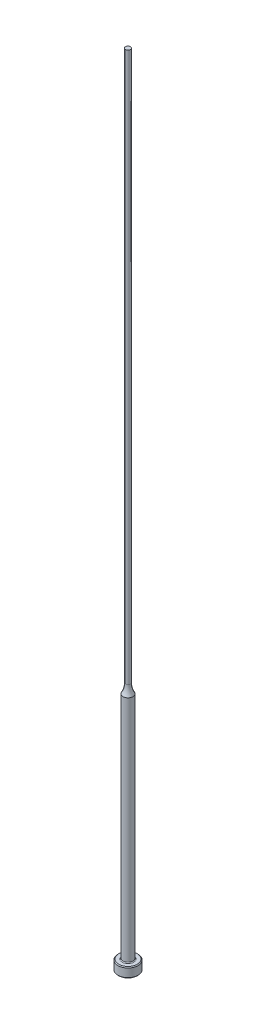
from build123d import *

# Parameters (mm, degrees)
CHAMFER1_SIZE = 0.254
FILLET1_R     = 0.254


with BuildPart() as part:
    # Sketch1 → Revolve1 (revolve)
    with BuildSketch(Plane.XY, mode=Mode.PRIVATE) as revolve1_sk:
        with BuildLine():
            Line((0, 0), (-3.175, 0))
            Line((-3.175, 0), (-3.175, 3.175))
            Line((-3.175, 3.175), (-1.5875, 3.175))
            Line((-1.5875, 3.175), (-1.5875, 76.2))
            ThreePointArc((-1.5875, 76.2), (-0.995388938, 77.686680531), (-0.79375, 79.274180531))
            Line((-0.79375, 79.274180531), (-0.79375, 254))
            Line((-0.79375, 254), (0, 254))
            Line((0, 254), (0, 0))
        make_face()
    revolve(revolve1_sk.sketch.rotate(Axis((0, 259.958771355, 0), (0, -1, 0)), 270), axis=Axis((0, 259.958771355, 0), (0, -1, 0)))

    # Chamfer1
    chamfer1_edges = [part.edges().sort_by_distance(p)[0] for p in [
        (0, 0, -3.175),
        (0, 3.175, -3.175),
    ]]
    chamfer(chamfer1_edges, length=CHAMFER1_SIZE)

    # Fillet1
    fillet1_edges = [part.edges().sort_by_distance(p)[0] for p in [
        (0, 3.175, -1.5875),
    ]]
    fillet(fillet1_edges, radius=FILLET1_R)


solid = part.part
